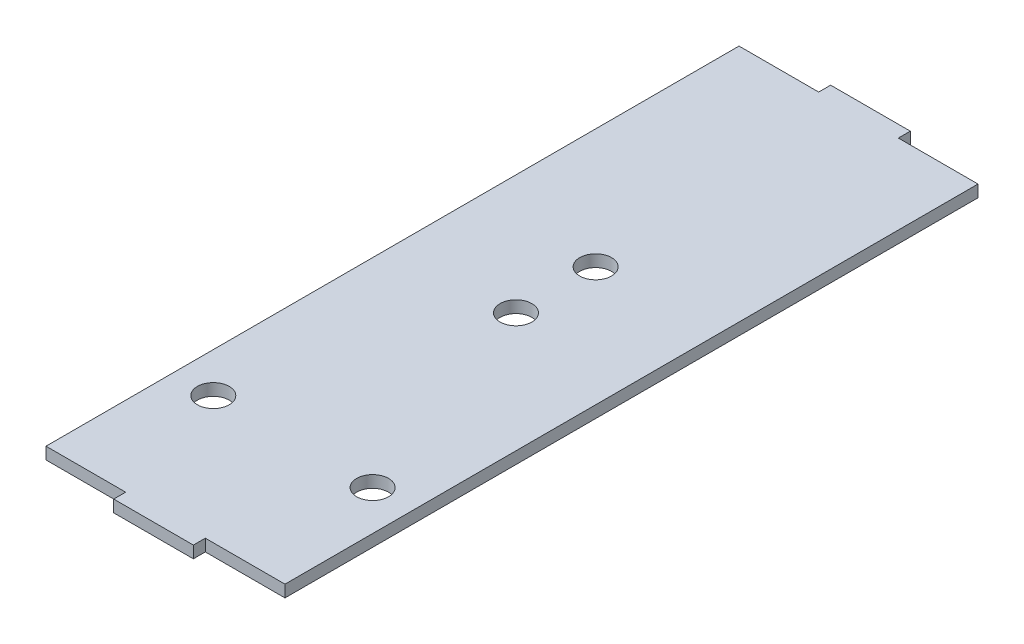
ISO-10303-21;
HEADER;
FILE_DESCRIPTION(('STEP AP214'),'2;1');
FILE_NAME('part.step','',(''),(''),'','','');
FILE_SCHEMA(('AUTOMOTIVE_DESIGN { 1 0 10303 214 1 1 1 1 }'));
ENDSEC;
DATA;
#1=APPLICATION_CONTEXT('core data for automotive mechanical design processes');
#2=APPLICATION_PROTOCOL_DEFINITION('international standard','automotive_design',2000,#1);
#3=PRODUCT_CONTEXT('',#1,'mechanical');
#4=PRODUCT('Part','Part','',(#3));
#5=PRODUCT_RELATED_PRODUCT_CATEGORY('part','',(#4));
#6=PRODUCT_DEFINITION_FORMATION('','',#4);
#7=PRODUCT_DEFINITION_CONTEXT('part definition',#1,'design');
#8=PRODUCT_DEFINITION('design','',#6,#7);
#9=PRODUCT_DEFINITION_SHAPE('','',#8);
#10=(LENGTH_UNIT() NAMED_UNIT(*) SI_UNIT(.MILLI.,.METRE.));
#11=(NAMED_UNIT(*) PLANE_ANGLE_UNIT() SI_UNIT($,.RADIAN.));
#12=(NAMED_UNIT(*) SI_UNIT($,.STERADIAN.) SOLID_ANGLE_UNIT());
#13=UNCERTAINTY_MEASURE_WITH_UNIT(LENGTH_MEASURE(1.E-05),#10,'distance_accuracy_value','');
#14=(GEOMETRIC_REPRESENTATION_CONTEXT(3) GLOBAL_UNCERTAINTY_ASSIGNED_CONTEXT((#13)) GLOBAL_UNIT_ASSIGNED_CONTEXT((#10,
#11,#12)) REPRESENTATION_CONTEXT('',''));
#15=CARTESIAN_POINT('',(0.,0.,0.));
#16=DIRECTION('',(0.,0.,1.));
#17=DIRECTION('',(1.,0.,0.));
#18=AXIS2_PLACEMENT_3D('',#15,#16,#17);
#19=CARTESIAN_POINT('',(30.,3.,-90.));
#20=DIRECTION('',(-1.,0.,0.));
#21=DIRECTION('',(0.,0.,1.));
#22=AXIS2_PLACEMENT_3D('',#19,#20,#21);
#23=PLANE('',#22);
#24=DIRECTION('',(0.,0.,-1.));
#25=VECTOR('',#24,1.);
#26=CARTESIAN_POINT('',(30.,3.,-90.));
#27=LINE('',#26,#25);
#28=CARTESIAN_POINT('',(30.,3.,87.));
#29=VERTEX_POINT('',#28);
#30=CARTESIAN_POINT('',(30.,3.,-87.));
#31=VERTEX_POINT('',#30);
#32=EDGE_CURVE('E140',#29,#31,#27,.T.);
#33=ORIENTED_EDGE('',*,*,#32,.F.);
#34=DIRECTION('',(0.,1.,0.));
#35=VECTOR('',#34,1.);
#36=CARTESIAN_POINT('',(30.,0.,87.));
#37=LINE('',#36,#35);
#38=CARTESIAN_POINT('',(30.,0.,87.));
#39=VERTEX_POINT('',#38);
#40=EDGE_CURVE('E196',#39,#29,#37,.T.);
#41=ORIENTED_EDGE('',*,*,#40,.F.);
#42=DIRECTION('',(0.,0.,-1.));
#43=VECTOR('',#42,1.);
#44=CARTESIAN_POINT('',(30.,0.,-90.));
#45=LINE('',#44,#43);
#46=CARTESIAN_POINT('',(30.,0.,-87.));
#47=VERTEX_POINT('',#46);
#48=EDGE_CURVE('E150',#39,#47,#45,.T.);
#49=ORIENTED_EDGE('',*,*,#48,.T.);
#50=DIRECTION('',(0.,1.,0.));
#51=VECTOR('',#50,1.);
#52=CARTESIAN_POINT('',(30.,0.,-87.));
#53=LINE('',#52,#51);
#54=EDGE_CURVE('E172',#47,#31,#53,.T.);
#55=ORIENTED_EDGE('',*,*,#54,.T.);
#56=EDGE_LOOP('',(#33,#41,#49,#55));
#57=FACE_BOUND('',#56,.T.);
#58=ADVANCED_FACE('F33',(#57),#23,.F.);
#59=CARTESIAN_POINT('',(-30.,3.,-90.));
#60=DIRECTION('',(0.,0.,1.));
#61=DIRECTION('',(1.,0.,0.));
#62=AXIS2_PLACEMENT_3D('',#59,#60,#61);
#63=PLANE('',#62);
#64=DIRECTION('',(-1.,0.,0.));
#65=VECTOR('',#64,1.);
#66=CARTESIAN_POINT('',(-30.,3.,-90.));
#67=LINE('',#66,#65);
#68=CARTESIAN_POINT('',(10.,3.,-90.));
#69=VERTEX_POINT('',#68);
#70=CARTESIAN_POINT('',(-10.,3.,-90.));
#71=VERTEX_POINT('',#70);
#72=EDGE_CURVE('E142',#69,#71,#67,.T.);
#73=ORIENTED_EDGE('',*,*,#72,.F.);
#74=DIRECTION('',(0.,1.,0.));
#75=VECTOR('',#74,1.);
#76=CARTESIAN_POINT('',(10.,0.,-90.));
#77=LINE('',#76,#75);
#78=CARTESIAN_POINT('',(10.,0.,-90.));
#79=VERTEX_POINT('',#78);
#80=EDGE_CURVE('E177',#79,#69,#77,.T.);
#81=ORIENTED_EDGE('',*,*,#80,.F.);
#82=DIRECTION('',(-1.,0.,0.));
#83=VECTOR('',#82,1.);
#84=CARTESIAN_POINT('',(-30.,0.,-90.));
#85=LINE('',#84,#83);
#86=CARTESIAN_POINT('',(-10.,0.,-90.));
#87=VERTEX_POINT('',#86);
#88=EDGE_CURVE('E145',#79,#87,#85,.T.);
#89=ORIENTED_EDGE('',*,*,#88,.T.);
#90=DIRECTION('',(0.,1.,0.));
#91=VECTOR('',#90,1.);
#92=CARTESIAN_POINT('',(-10.,0.,-90.));
#93=LINE('',#92,#91);
#94=EDGE_CURVE('E153',#87,#71,#93,.T.);
#95=ORIENTED_EDGE('',*,*,#94,.T.);
#96=EDGE_LOOP('',(#73,#81,#89,#95));
#97=FACE_BOUND('',#96,.T.);
#98=ADVANCED_FACE('F276',(#97),#63,.F.);
#99=CARTESIAN_POINT('',(-30.,3.,-90.));
#100=DIRECTION('',(1.,0.,0.));
#101=DIRECTION('',(0.,0.,-1.));
#102=AXIS2_PLACEMENT_3D('',#99,#100,#101);
#103=PLANE('',#102);
#104=DIRECTION('',(0.,0.,1.));
#105=VECTOR('',#104,1.);
#106=CARTESIAN_POINT('',(-30.,0.,-90.));
#107=LINE('',#106,#105);
#108=CARTESIAN_POINT('',(-30.,0.,-87.));
#109=VERTEX_POINT('',#108);
#110=CARTESIAN_POINT('',(-30.,0.,87.));
#111=VERTEX_POINT('',#110);
#112=EDGE_CURVE('E141',#109,#111,#107,.T.);
#113=ORIENTED_EDGE('',*,*,#112,.T.);
#114=DIRECTION('',(0.,1.,0.));
#115=VECTOR('',#114,1.);
#116=CARTESIAN_POINT('',(-30.,0.,87.));
#117=LINE('',#116,#115);
#118=CARTESIAN_POINT('',(-30.,3.,87.));
#119=VERTEX_POINT('',#118);
#120=EDGE_CURVE('E208',#111,#119,#117,.T.);
#121=ORIENTED_EDGE('',*,*,#120,.T.);
#122=DIRECTION('',(0.,0.,1.));
#123=VECTOR('',#122,1.);
#124=CARTESIAN_POINT('',(-30.,3.,-90.));
#125=LINE('',#124,#123);
#126=CARTESIAN_POINT('',(-30.,3.,-87.));
#127=VERTEX_POINT('',#126);
#128=EDGE_CURVE('E41',#127,#119,#125,.T.);
#129=ORIENTED_EDGE('',*,*,#128,.F.);
#130=DIRECTION('',(0.,1.,0.));
#131=VECTOR('',#130,1.);
#132=CARTESIAN_POINT('',(-30.,0.,-87.));
#133=LINE('',#132,#131);
#134=EDGE_CURVE('E158',#109,#127,#133,.T.);
#135=ORIENTED_EDGE('',*,*,#134,.F.);
#136=EDGE_LOOP('',(#113,#121,#129,#135));
#137=FACE_BOUND('',#136,.T.);
#138=ADVANCED_FACE('F265',(#137),#103,.F.);
#139=CARTESIAN_POINT('',(-30.,3.,90.));
#140=DIRECTION('',(0.,0.,-1.));
#141=DIRECTION('',(-1.,0.,0.));
#142=AXIS2_PLACEMENT_3D('',#139,#140,#141);
#143=PLANE('',#142);
#144=DIRECTION('',(1.,0.,0.));
#145=VECTOR('',#144,1.);
#146=CARTESIAN_POINT('',(-30.,3.,90.));
#147=LINE('',#146,#145);
#148=CARTESIAN_POINT('',(-10.,3.,90.));
#149=VERTEX_POINT('',#148);
#150=CARTESIAN_POINT('',(10.,3.,90.));
#151=VERTEX_POINT('',#150);
#152=EDGE_CURVE('E11',#149,#151,#147,.T.);
#153=ORIENTED_EDGE('',*,*,#152,.F.);
#154=DIRECTION('',(0.,1.,0.));
#155=VECTOR('',#154,1.);
#156=CARTESIAN_POINT('',(-10.,0.,90.));
#157=LINE('',#156,#155);
#158=CARTESIAN_POINT('',(-10.,0.,90.));
#159=VERTEX_POINT('',#158);
#160=EDGE_CURVE('E126',#159,#149,#157,.T.);
#161=ORIENTED_EDGE('',*,*,#160,.F.);
#162=DIRECTION('',(1.,0.,0.));
#163=VECTOR('',#162,1.);
#164=CARTESIAN_POINT('',(-30.,0.,90.));
#165=LINE('',#164,#163);
#166=CARTESIAN_POINT('',(10.,0.,90.));
#167=VERTEX_POINT('',#166);
#168=EDGE_CURVE('E36',#159,#167,#165,.T.);
#169=ORIENTED_EDGE('',*,*,#168,.T.);
#170=DIRECTION('',(0.,1.,0.));
#171=VECTOR('',#170,1.);
#172=CARTESIAN_POINT('',(10.,0.,90.));
#173=LINE('',#172,#171);
#174=EDGE_CURVE('E191',#167,#151,#173,.T.);
#175=ORIENTED_EDGE('',*,*,#174,.T.);
#176=EDGE_LOOP('',(#153,#161,#169,#175));
#177=FACE_BOUND('',#176,.T.);
#178=ADVANCED_FACE('F135',(#177),#143,.F.);
#179=CARTESIAN_POINT('',(0.,3.,0.));
#180=DIRECTION('',(0.,1.,0.));
#181=DIRECTION('',(0.,0.,1.));
#182=AXIS2_PLACEMENT_3D('',#179,#180,#181);
#183=PLANE('',#182);
#184=CARTESIAN_POINT('',(2.70616862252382E-13,3.,-1.00000000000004));
#185=DIRECTION('',(0.,1.,0.));
#186=DIRECTION('',(0.,0.,1.));
#187=AXIS2_PLACEMENT_3D('',#184,#185,#186);
#188=CIRCLE('',#187,4.);
#189=CARTESIAN_POINT('',(2.70616862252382E-13,3.,2.99999999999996));
#190=VERTEX_POINT('',#189);
#191=EDGE_CURVE('E236',#190,#190,#188,.T.);
#192=ORIENTED_EDGE('',*,*,#191,.F.);
#193=EDGE_LOOP('',(#192));
#194=FACE_BOUND('',#193,.T.);
#195=CARTESIAN_POINT('',(2.70616862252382E-13,3.,-21.));
#196=DIRECTION('',(0.,1.,0.));
#197=DIRECTION('',(0.,0.,1.));
#198=AXIS2_PLACEMENT_3D('',#195,#196,#197);
#199=CIRCLE('',#198,4.00000000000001);
#200=CARTESIAN_POINT('',(2.70616862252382E-13,3.,-17.));
#201=VERTEX_POINT('',#200);
#202=EDGE_CURVE('E230',#201,#201,#199,.T.);
#203=ORIENTED_EDGE('',*,*,#202,.F.);
#204=EDGE_LOOP('',(#203));
#205=FACE_BOUND('',#204,.T.);
#206=CARTESIAN_POINT('',(20.0000000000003,3.,55.));
#207=DIRECTION('',(0.,1.,0.));
#208=DIRECTION('',(0.,0.,1.));
#209=AXIS2_PLACEMENT_3D('',#206,#207,#208);
#210=CIRCLE('',#209,4.);
#211=CARTESIAN_POINT('',(20.0000000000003,3.,59.));
#212=VERTEX_POINT('',#211);
#213=EDGE_CURVE('E224',#212,#212,#210,.T.);
#214=ORIENTED_EDGE('',*,*,#213,.F.);
#215=EDGE_LOOP('',(#214));
#216=FACE_BOUND('',#215,.T.);
#217=CARTESIAN_POINT('',(-19.9999999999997,3.,55.));
#218=DIRECTION('',(0.,1.,0.));
#219=DIRECTION('',(0.,0.,1.));
#220=AXIS2_PLACEMENT_3D('',#217,#218,#219);
#221=CIRCLE('',#220,4.);
#222=CARTESIAN_POINT('',(-19.9999999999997,3.,59.));
#223=VERTEX_POINT('',#222);
#224=EDGE_CURVE('E218',#223,#223,#221,.T.);
#225=ORIENTED_EDGE('',*,*,#224,.F.);
#226=EDGE_LOOP('',(#225));
#227=FACE_BOUND('',#226,.T.);
#228=DIRECTION('',(-1.,0.,0.));
#229=VECTOR('',#228,1.);
#230=CARTESIAN_POINT('',(-30.,3.,87.));
#231=LINE('',#230,#229);
#232=CARTESIAN_POINT('',(-10.,3.,87.));
#233=VERTEX_POINT('',#232);
#234=EDGE_CURVE('E131',#233,#119,#231,.T.);
#235=ORIENTED_EDGE('',*,*,#234,.F.);
#236=DIRECTION('',(0.,0.,-1.));
#237=VECTOR('',#236,1.);
#238=CARTESIAN_POINT('',(-10.,3.,90.));
#239=LINE('',#238,#237);
#240=EDGE_CURVE('E214',#149,#233,#239,.T.);
#241=ORIENTED_EDGE('',*,*,#240,.F.);
#242=ORIENTED_EDGE('',*,*,#152,.T.);
#243=DIRECTION('',(0.,0.,1.));
#244=VECTOR('',#243,1.);
#245=CARTESIAN_POINT('',(10.,3.,90.));
#246=LINE('',#245,#244);
#247=CARTESIAN_POINT('',(10.,3.,87.));
#248=VERTEX_POINT('',#247);
#249=EDGE_CURVE('E201',#248,#151,#246,.T.);
#250=ORIENTED_EDGE('',*,*,#249,.F.);
#251=DIRECTION('',(-1.,0.,0.));
#252=VECTOR('',#251,1.);
#253=CARTESIAN_POINT('',(30.,3.,87.));
#254=LINE('',#253,#252);
#255=EDGE_CURVE('E205',#29,#248,#254,.T.);
#256=ORIENTED_EDGE('',*,*,#255,.F.);
#257=ORIENTED_EDGE('',*,*,#32,.T.);
#258=DIRECTION('',(1.,0.,0.));
#259=VECTOR('',#258,1.);
#260=CARTESIAN_POINT('',(30.,3.,-87.));
#261=LINE('',#260,#259);
#262=CARTESIAN_POINT('',(10.,3.,-87.));
#263=VERTEX_POINT('',#262);
#264=EDGE_CURVE('E184',#263,#31,#261,.T.);
#265=ORIENTED_EDGE('',*,*,#264,.F.);
#266=DIRECTION('',(0.,0.,1.));
#267=VECTOR('',#266,1.);
#268=CARTESIAN_POINT('',(10.,3.,-90.));
#269=LINE('',#268,#267);
#270=EDGE_CURVE('E188',#69,#263,#269,.T.);
#271=ORIENTED_EDGE('',*,*,#270,.F.);
#272=ORIENTED_EDGE('',*,*,#72,.T.);
#273=DIRECTION('',(0.,0.,-1.));
#274=VECTOR('',#273,1.);
#275=CARTESIAN_POINT('',(-10.,3.,-90.));
#276=LINE('',#275,#274);
#277=CARTESIAN_POINT('',(-10.,3.,-87.));
#278=VERTEX_POINT('',#277);
#279=EDGE_CURVE('E165',#278,#71,#276,.T.);
#280=ORIENTED_EDGE('',*,*,#279,.F.);
#281=DIRECTION('',(1.,0.,0.));
#282=VECTOR('',#281,1.);
#283=CARTESIAN_POINT('',(-30.,3.,-87.));
#284=LINE('',#283,#282);
#285=EDGE_CURVE('E169',#127,#278,#284,.T.);
#286=ORIENTED_EDGE('',*,*,#285,.F.);
#287=ORIENTED_EDGE('',*,*,#128,.T.);
#288=EDGE_LOOP('',(#235,#241,#242,#250,#256,#257,#265,#271,#272,#280,#286,#287));
#289=FACE_BOUND('',#288,.T.);
#290=ADVANCED_FACE('F251',(#194,#205,#216,#227,#289),#183,.T.);
#291=CARTESIAN_POINT('',(0.,0.,0.));
#292=DIRECTION('',(0.,1.,0.));
#293=DIRECTION('',(0.,0.,1.));
#294=AXIS2_PLACEMENT_3D('',#291,#292,#293);
#295=PLANE('',#294);
#296=CARTESIAN_POINT('',(2.70616862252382E-13,0.,-1.00000000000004));
#297=DIRECTION('',(0.,1.,0.));
#298=DIRECTION('',(0.,0.,1.));
#299=AXIS2_PLACEMENT_3D('',#296,#297,#298);
#300=CIRCLE('',#299,4.);
#301=CARTESIAN_POINT('',(2.70616862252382E-13,0.,2.99999999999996));
#302=VERTEX_POINT('',#301);
#303=EDGE_CURVE('E233',#302,#302,#300,.T.);
#304=ORIENTED_EDGE('',*,*,#303,.T.);
#305=EDGE_LOOP('',(#304));
#306=FACE_BOUND('',#305,.T.);
#307=CARTESIAN_POINT('',(2.70616862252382E-13,0.,-21.));
#308=DIRECTION('',(0.,1.,0.));
#309=DIRECTION('',(0.,0.,1.));
#310=AXIS2_PLACEMENT_3D('',#307,#308,#309);
#311=CIRCLE('',#310,4.00000000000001);
#312=CARTESIAN_POINT('',(2.70616862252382E-13,0.,-17.));
#313=VERTEX_POINT('',#312);
#314=EDGE_CURVE('E227',#313,#313,#311,.T.);
#315=ORIENTED_EDGE('',*,*,#314,.T.);
#316=EDGE_LOOP('',(#315));
#317=FACE_BOUND('',#316,.T.);
#318=CARTESIAN_POINT('',(20.0000000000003,0.,55.));
#319=DIRECTION('',(0.,1.,0.));
#320=DIRECTION('',(0.,0.,1.));
#321=AXIS2_PLACEMENT_3D('',#318,#319,#320);
#322=CIRCLE('',#321,4.);
#323=CARTESIAN_POINT('',(20.0000000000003,0.,59.));
#324=VERTEX_POINT('',#323);
#325=EDGE_CURVE('E221',#324,#324,#322,.T.);
#326=ORIENTED_EDGE('',*,*,#325,.T.);
#327=EDGE_LOOP('',(#326));
#328=FACE_BOUND('',#327,.T.);
#329=CARTESIAN_POINT('',(-19.9999999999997,0.,55.));
#330=DIRECTION('',(0.,1.,0.));
#331=DIRECTION('',(0.,0.,1.));
#332=AXIS2_PLACEMENT_3D('',#329,#330,#331);
#333=CIRCLE('',#332,4.);
#334=CARTESIAN_POINT('',(-19.9999999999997,0.,59.));
#335=VERTEX_POINT('',#334);
#336=EDGE_CURVE('E216',#335,#335,#333,.T.);
#337=ORIENTED_EDGE('',*,*,#336,.T.);
#338=EDGE_LOOP('',(#337));
#339=FACE_BOUND('',#338,.T.);
#340=DIRECTION('',(0.,0.,-1.));
#341=VECTOR('',#340,1.);
#342=CARTESIAN_POINT('',(-10.,0.,90.));
#343=LINE('',#342,#341);
#344=CARTESIAN_POINT('',(-10.,0.,87.));
#345=VERTEX_POINT('',#344);
#346=EDGE_CURVE('E122',#159,#345,#343,.T.);
#347=ORIENTED_EDGE('',*,*,#346,.T.);
#348=DIRECTION('',(-1.,0.,0.));
#349=VECTOR('',#348,1.);
#350=CARTESIAN_POINT('',(-30.,0.,87.));
#351=LINE('',#350,#349);
#352=EDGE_CURVE('E49',#345,#111,#351,.T.);
#353=ORIENTED_EDGE('',*,*,#352,.T.);
#354=ORIENTED_EDGE('',*,*,#112,.F.);
#355=DIRECTION('',(1.,0.,0.));
#356=VECTOR('',#355,1.);
#357=CARTESIAN_POINT('',(-30.,0.,-87.));
#358=LINE('',#357,#356);
#359=CARTESIAN_POINT('',(-10.,0.,-87.));
#360=VERTEX_POINT('',#359);
#361=EDGE_CURVE('E168',#109,#360,#358,.T.);
#362=ORIENTED_EDGE('',*,*,#361,.T.);
#363=DIRECTION('',(0.,0.,-1.));
#364=VECTOR('',#363,1.);
#365=CARTESIAN_POINT('',(-10.,0.,-90.));
#366=LINE('',#365,#364);
#367=EDGE_CURVE('E161',#360,#87,#366,.T.);
#368=ORIENTED_EDGE('',*,*,#367,.T.);
#369=ORIENTED_EDGE('',*,*,#88,.F.);
#370=DIRECTION('',(0.,0.,1.));
#371=VECTOR('',#370,1.);
#372=CARTESIAN_POINT('',(10.,0.,-90.));
#373=LINE('',#372,#371);
#374=CARTESIAN_POINT('',(10.,0.,-87.));
#375=VERTEX_POINT('',#374);
#376=EDGE_CURVE('E187',#79,#375,#373,.T.);
#377=ORIENTED_EDGE('',*,*,#376,.T.);
#378=DIRECTION('',(1.,0.,0.));
#379=VECTOR('',#378,1.);
#380=CARTESIAN_POINT('',(30.,0.,-87.));
#381=LINE('',#380,#379);
#382=EDGE_CURVE('E180',#375,#47,#381,.T.);
#383=ORIENTED_EDGE('',*,*,#382,.T.);
#384=ORIENTED_EDGE('',*,*,#48,.F.);
#385=DIRECTION('',(-1.,0.,0.));
#386=VECTOR('',#385,1.);
#387=CARTESIAN_POINT('',(30.,0.,87.));
#388=LINE('',#387,#386);
#389=CARTESIAN_POINT('',(10.,0.,87.));
#390=VERTEX_POINT('',#389);
#391=EDGE_CURVE('E204',#39,#390,#388,.T.);
#392=ORIENTED_EDGE('',*,*,#391,.T.);
#393=DIRECTION('',(0.,0.,1.));
#394=VECTOR('',#393,1.);
#395=CARTESIAN_POINT('',(10.,0.,90.));
#396=LINE('',#395,#394);
#397=EDGE_CURVE('E57',#390,#167,#396,.T.);
#398=ORIENTED_EDGE('',*,*,#397,.T.);
#399=ORIENTED_EDGE('',*,*,#168,.F.);
#400=EDGE_LOOP('',(#347,#353,#354,#362,#368,#369,#377,#383,#384,#392,#398,#399));
#401=FACE_BOUND('',#400,.T.);
#402=ADVANCED_FACE('F138',(#306,#317,#328,#339,#401),#295,.F.);
#403=CARTESIAN_POINT('',(-10.,0.,-90.));
#404=DIRECTION('',(1.,0.,0.));
#405=DIRECTION('',(0.,0.,-1.));
#406=AXIS2_PLACEMENT_3D('',#403,#404,#405);
#407=PLANE('',#406);
#408=ORIENTED_EDGE('',*,*,#279,.T.);
#409=ORIENTED_EDGE('',*,*,#94,.F.);
#410=ORIENTED_EDGE('',*,*,#367,.F.);
#411=DIRECTION('',(0.,1.,0.));
#412=VECTOR('',#411,1.);
#413=CARTESIAN_POINT('',(-10.,0.,-87.));
#414=LINE('',#413,#412);
#415=EDGE_CURVE('E160',#360,#278,#414,.T.);
#416=ORIENTED_EDGE('',*,*,#415,.T.);
#417=EDGE_LOOP('',(#408,#409,#410,#416));
#418=FACE_BOUND('',#417,.T.);
#419=ADVANCED_FACE('F272',(#418),#407,.F.);
#420=CARTESIAN_POINT('',(-30.,0.,-87.));
#421=DIRECTION('',(0.,0.,1.));
#422=DIRECTION('',(1.,0.,0.));
#423=AXIS2_PLACEMENT_3D('',#420,#421,#422);
#424=PLANE('',#423);
#425=ORIENTED_EDGE('',*,*,#285,.T.);
#426=ORIENTED_EDGE('',*,*,#415,.F.);
#427=ORIENTED_EDGE('',*,*,#361,.F.);
#428=ORIENTED_EDGE('',*,*,#134,.T.);
#429=EDGE_LOOP('',(#425,#426,#427,#428));
#430=FACE_BOUND('',#429,.T.);
#431=ADVANCED_FACE('F269',(#430),#424,.F.);
#432=CARTESIAN_POINT('',(30.,0.,-87.));
#433=DIRECTION('',(0.,0.,1.));
#434=DIRECTION('',(1.,0.,0.));
#435=AXIS2_PLACEMENT_3D('',#432,#433,#434);
#436=PLANE('',#435);
#437=ORIENTED_EDGE('',*,*,#264,.T.);
#438=ORIENTED_EDGE('',*,*,#54,.F.);
#439=ORIENTED_EDGE('',*,*,#382,.F.);
#440=DIRECTION('',(0.,1.,0.));
#441=VECTOR('',#440,1.);
#442=CARTESIAN_POINT('',(10.,0.,-87.));
#443=LINE('',#442,#441);
#444=EDGE_CURVE('E179',#375,#263,#443,.T.);
#445=ORIENTED_EDGE('',*,*,#444,.T.);
#446=EDGE_LOOP('',(#437,#438,#439,#445));
#447=FACE_BOUND('',#446,.T.);
#448=ADVANCED_FACE('F285',(#447),#436,.F.);
#449=CARTESIAN_POINT('',(10.,0.,-90.));
#450=DIRECTION('',(-1.,0.,0.));
#451=DIRECTION('',(0.,0.,1.));
#452=AXIS2_PLACEMENT_3D('',#449,#450,#451);
#453=PLANE('',#452);
#454=ORIENTED_EDGE('',*,*,#270,.T.);
#455=ORIENTED_EDGE('',*,*,#444,.F.);
#456=ORIENTED_EDGE('',*,*,#376,.F.);
#457=ORIENTED_EDGE('',*,*,#80,.T.);
#458=EDGE_LOOP('',(#454,#455,#456,#457));
#459=FACE_BOUND('',#458,.T.);
#460=ADVANCED_FACE('F281',(#459),#453,.F.);
#461=CARTESIAN_POINT('',(10.,0.,90.));
#462=DIRECTION('',(-1.,0.,0.));
#463=DIRECTION('',(0.,0.,1.));
#464=AXIS2_PLACEMENT_3D('',#461,#462,#463);
#465=PLANE('',#464);
#466=ORIENTED_EDGE('',*,*,#249,.T.);
#467=ORIENTED_EDGE('',*,*,#174,.F.);
#468=ORIENTED_EDGE('',*,*,#397,.F.);
#469=DIRECTION('',(0.,1.,0.));
#470=VECTOR('',#469,1.);
#471=CARTESIAN_POINT('',(10.,0.,87.));
#472=LINE('',#471,#470);
#473=EDGE_CURVE('E198',#390,#248,#472,.T.);
#474=ORIENTED_EDGE('',*,*,#473,.T.);
#475=EDGE_LOOP('',(#466,#467,#468,#474));
#476=FACE_BOUND('',#475,.T.);
#477=ADVANCED_FACE('F294',(#476),#465,.F.);
#478=CARTESIAN_POINT('',(30.,0.,87.));
#479=DIRECTION('',(0.,0.,-1.));
#480=DIRECTION('',(-1.,0.,0.));
#481=AXIS2_PLACEMENT_3D('',#478,#479,#480);
#482=PLANE('',#481);
#483=ORIENTED_EDGE('',*,*,#255,.T.);
#484=ORIENTED_EDGE('',*,*,#473,.F.);
#485=ORIENTED_EDGE('',*,*,#391,.F.);
#486=ORIENTED_EDGE('',*,*,#40,.T.);
#487=EDGE_LOOP('',(#483,#484,#485,#486));
#488=FACE_BOUND('',#487,.T.);
#489=ADVANCED_FACE('F291',(#488),#482,.F.);
#490=CARTESIAN_POINT('',(-30.,0.,87.));
#491=DIRECTION('',(0.,0.,-1.));
#492=DIRECTION('',(-1.,0.,0.));
#493=AXIS2_PLACEMENT_3D('',#490,#491,#492);
#494=PLANE('',#493);
#495=ORIENTED_EDGE('',*,*,#234,.T.);
#496=ORIENTED_EDGE('',*,*,#120,.F.);
#497=ORIENTED_EDGE('',*,*,#352,.F.);
#498=DIRECTION('',(0.,1.,0.));
#499=VECTOR('',#498,1.);
#500=CARTESIAN_POINT('',(-10.,0.,87.));
#501=LINE('',#500,#499);
#502=EDGE_CURVE('E128',#345,#233,#501,.T.);
#503=ORIENTED_EDGE('',*,*,#502,.T.);
#504=EDGE_LOOP('',(#495,#496,#497,#503));
#505=FACE_BOUND('',#504,.T.);
#506=ADVANCED_FACE('F264',(#505),#494,.F.);
#507=CARTESIAN_POINT('',(-10.,0.,90.));
#508=DIRECTION('',(1.,0.,0.));
#509=DIRECTION('',(0.,0.,-1.));
#510=AXIS2_PLACEMENT_3D('',#507,#508,#509);
#511=PLANE('',#510);
#512=ORIENTED_EDGE('',*,*,#240,.T.);
#513=ORIENTED_EDGE('',*,*,#502,.F.);
#514=ORIENTED_EDGE('',*,*,#346,.F.);
#515=ORIENTED_EDGE('',*,*,#160,.T.);
#516=EDGE_LOOP('',(#512,#513,#514,#515));
#517=FACE_BOUND('',#516,.T.);
#518=ADVANCED_FACE('F125',(#517),#511,.F.);
#519=CARTESIAN_POINT('',(-19.9999999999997,0.,55.));
#520=DIRECTION('',(0.,1.,0.));
#521=DIRECTION('',(0.,0.,1.));
#522=AXIS2_PLACEMENT_3D('',#519,#520,#521);
#523=CYLINDRICAL_SURFACE('',#522,4.);
#524=ORIENTED_EDGE('',*,*,#336,.F.);
#525=EDGE_LOOP('',(#524));
#526=FACE_BOUND('',#525,.T.);
#527=ORIENTED_EDGE('',*,*,#224,.T.);
#528=EDGE_LOOP('',(#527));
#529=FACE_BOUND('',#528,.T.);
#530=ADVANCED_FACE('F357',(#526,#529),#523,.F.);
#531=CARTESIAN_POINT('',(20.0000000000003,0.,55.));
#532=DIRECTION('',(0.,1.,0.));
#533=DIRECTION('',(0.,0.,1.));
#534=AXIS2_PLACEMENT_3D('',#531,#532,#533);
#535=CYLINDRICAL_SURFACE('',#534,4.);
#536=ORIENTED_EDGE('',*,*,#325,.F.);
#537=EDGE_LOOP('',(#536));
#538=FACE_BOUND('',#537,.T.);
#539=ORIENTED_EDGE('',*,*,#213,.T.);
#540=EDGE_LOOP('',(#539));
#541=FACE_BOUND('',#540,.T.);
#542=ADVANCED_FACE('F379',(#538,#541),#535,.F.);
#543=CARTESIAN_POINT('',(2.70616862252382E-13,0.,-21.));
#544=DIRECTION('',(0.,1.,0.));
#545=DIRECTION('',(0.,0.,1.));
#546=AXIS2_PLACEMENT_3D('',#543,#544,#545);
#547=CYLINDRICAL_SURFACE('',#546,4.00000000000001);
#548=ORIENTED_EDGE('',*,*,#314,.F.);
#549=EDGE_LOOP('',(#548));
#550=FACE_BOUND('',#549,.T.);
#551=ORIENTED_EDGE('',*,*,#202,.T.);
#552=EDGE_LOOP('',(#551));
#553=FACE_BOUND('',#552,.T.);
#554=ADVANCED_FACE('F247',(#550,#553),#547,.F.);
#555=CARTESIAN_POINT('',(2.70616862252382E-13,0.,-1.00000000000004));
#556=DIRECTION('',(0.,1.,0.));
#557=DIRECTION('',(0.,0.,1.));
#558=AXIS2_PLACEMENT_3D('',#555,#556,#557);
#559=CYLINDRICAL_SURFACE('',#558,4.);
#560=ORIENTED_EDGE('',*,*,#303,.F.);
#561=EDGE_LOOP('',(#560));
#562=FACE_BOUND('',#561,.T.);
#563=ORIENTED_EDGE('',*,*,#191,.T.);
#564=EDGE_LOOP('',(#563));
#565=FACE_BOUND('',#564,.T.);
#566=ADVANCED_FACE('F244',(#562,#565),#559,.F.);
#567=CLOSED_SHELL('',(#58,#98,#138,#178,#290,#402,#419,#431,#448,#460,#477,#489,#506,#518,#530,
#542,#554,#566));
#568=MANIFOLD_SOLID_BREP('B2',#567);
#569=ADVANCED_BREP_SHAPE_REPRESENTATION('',(#18,#568),#14);
#570=SHAPE_DEFINITION_REPRESENTATION(#9,#569);
ENDSEC;
END-ISO-10303-21;
